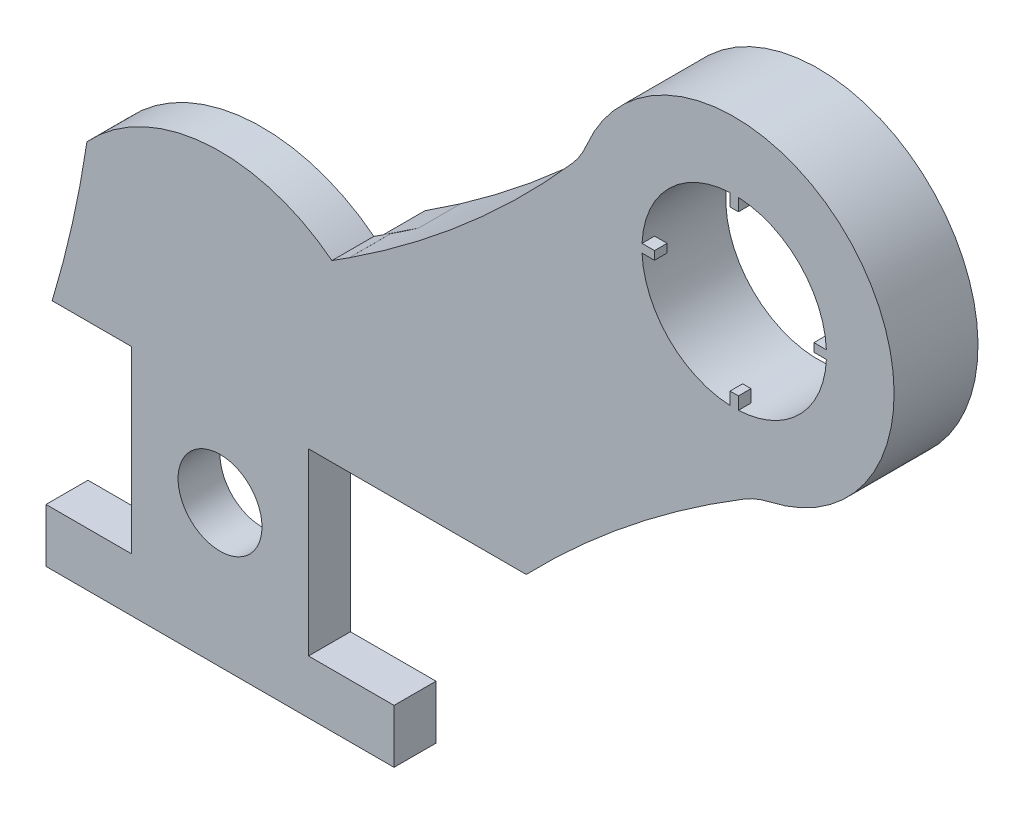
from build123d import *

# Parameters (mm, degrees)
BODY_DEPTH            = 10
SKETCH2_R             = 5
ATTACHMENT_HOLE_DEPTH = 115.950033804
CUT_EXTRUDE28_DEPTH   = 115.950033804
CUT_EXTRUDE30_DEPTH   = 5
FILLET1_R             = 10
FILLET2_R             = 10
SKETCH36_R            = 11
CUT_EXTRUDE31_DEPTH   = 10
CIRPATTERN2_COUNT     = 2
CIRPATTERN2_ANGLE     = 50
CUT_EXTRUDE32_DEPTH   = 10
CUT_EXTRUDE33_DEPTH   = 10
CUT_EXTRUDE35_DEPTH   = 10
CUT_EXTRUDE39_DEPTH   = 5
BOSS_EXTRUDE1_DEPTH   = 5
SKETCH43_W            = 1
SKETCH43_H            = 3
SKETCH43_W_2          = 3
SKETCH43_H_2          = 1
BOSS_EXTRUDE2_DEPTH   = 1.5


with BuildPart() as part:
    # Sketch1 → Body (new body)
    with BuildSketch(Plane.XY):
        with BuildLine():
            ThreePointArc((-57.453333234, -48.209070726), (-21.71033315, 5.618934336), (-16.22448152, 70))
            ThreePointArc((-16.22448152, 70), (0, 99.05869357), (16.22448152, 70))
            ThreePointArc((16.22448152, 70), (21.71033315, 5.618934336), (57.453333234, -48.209070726))
            ThreePointArc((57.453333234, -48.209070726), (0, -75), (-57.453333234, -48.209070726))
        make_face()
    extrude(amount=BODY_DEPTH)

    # Sketch2 → Attachment Hole (cut, through all)
    with BuildSketch(Plane.XY.offset(10)):
        Circle(SKETCH2_R)
    extrude(amount=-ATTACHMENT_HOLE_DEPTH, mode=Mode.SUBTRACT)

    # Sketch34 → Cut-Extrude28 (cut, through all)
    with BuildSketch(Plane.XY.offset(10)):
        with BuildLine():
            Line((-20.993197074, 10.845815), (-10.542895, 10.845815))
            Line((-10.542895, 10.845815), (-10.542895, -10.542895))
            Line((-10.542895, -10.542895), (-20.741205, -10.542895))
            Line((-20.741205, -10.542895), (-20.741205, -16.942445))
            Line((-20.741205, -16.942445), (20.741205, -16.942445))
            Line((20.741205, -16.942445), (20.741205, -10.542895))
            Line((20.741205, -10.542895), (10.542895, -10.542895))
            Line((10.542895, -10.542895), (10.542895, 10.845815))
            Line((10.542895, 10.845815), (20.993197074, 10.845815))
            ThreePointArc((20.993197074, 10.845815), (36.689111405, -20.246199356), (57.453333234, -48.209070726))
            ThreePointArc((57.453333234, -48.209070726), (0, -75), (-57.453333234, -48.209070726))
            ThreePointArc((-57.453333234, -48.209070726), (-35.302517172, -21.102274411), (-20.993197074, 10.845815))
        make_face()
    extrude(amount=-CUT_EXTRUDE28_DEPTH, mode=Mode.SUBTRACT)

    # Sketch35 → Cut-Extrude30 (cut)
    with BuildSketch(Plane(origin=(0, 0, 0), x_dir=(-1, 0, 0), z_dir=(0, 0, -1))):
        with BuildLine():
            Line((20.993197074, 10.845815), (10.542895, 10.845815))
            Line((10.542895, 10.845815), (10.542895, -10.542895))
            Line((10.542895, -10.542895), (20.741205, -10.542895))
            Line((20.741205, -10.542895), (20.741205, -16.942445))
            Line((20.741205, -16.942445), (-20.741205, -16.942445))
            Line((-20.741205, -16.942445), (-20.741205, -10.542895))
            Line((-20.741205, -10.542895), (-10.542895, -10.542895))
            Line((-10.542895, -10.542895), (-10.542895, 10.845815))
            Line((-10.542895, 10.845815), (-20.993197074, 10.845815))
            ThreePointArc((-20.993197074, 10.845815), (-18.675130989, 19.753520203), (-16.85963199, 28.777078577))
            ThreePointArc((-16.85963199, 28.777078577), (0, 36.631345), (16.85963199, 28.777078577))
            ThreePointArc((16.85963199, 28.777078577), (18.631142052, 19.74337975), (20.993197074, 10.845815))
        make_face()
    extrude(amount=-CUT_EXTRUDE30_DEPTH, mode=Mode.SUBTRACT)

    # Fillet1
    fillet1_edges = [part.edges().sort_by_distance(p)[0] for p in [
        (16.22448152, 70, 5),
    ]]
    fillet(fillet1_edges, radius=FILLET1_R)

    # Fillet2
    fillet2_edges = [part.edges().sort_by_distance(p)[0] for p in [
        (-16.22448152, 70, 5),
    ]]
    fillet(fillet2_edges, radius=FILLET2_R)

    # Sketch36 → Cut-Extrude31 (cut)
    with BuildSketch(Plane.XY.offset(10)):
        with Locations((0, 80)):
            Circle(SKETCH36_R)
    extrude(amount=-CUT_EXTRUDE31_DEPTH, mode=Mode.SUBTRACT)


with BuildPart() as cirpattern2_1:
    # CirPattern2: pattern copy
    add(part.part.rotate(Axis((0, 0, 0), (0, 0, -1)), 1 * CIRPATTERN2_ANGLE / (CIRPATTERN2_COUNT - 1)))


with BuildPart() as cut_extrude32_tool:
    # Sketch37 → Cut-Extrude32 (new body)
    with BuildSketch(Plane(origin=(0, 0, 0), x_dir=(-1, 0, 0), z_dir=(0, 0, -1))):
        Polygon((10.542895, 10.845815), (34.076027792, 10.845815), (33.80424088, -11.158579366), (20.741205, -10.542895), (10.542895, -10.542895), align=None)
        Polygon((-8.248307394, -16.942445), (10.542895, -16.942445), (10.542895, -32.17907609), (-8.248307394, -31.293412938), align=None)
        Polygon((-20.741205, -10.542895), (-10.542895, -10.542895), (-10.542895, 10.845815), (-26.542503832, 10.845815), (-26.542503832, -10.542895), align=None)
        Polygon((-23.641854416, 102.332870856), (-23.641854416, 42.267932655), (50.932087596, 42.267932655), (49.628646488, 108.669066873), align=None)
    extrude(amount=-CUT_EXTRUDE32_DEPTH)


with BuildPart() as part_1:
    add(part.part)

    # Cut-Extrude32: cut by cut_extrude32_tool
    add(cut_extrude32_tool.part, mode=Mode.SUBTRACT)

    # Sketch40 → Cut-Extrude35 (cut)
    with BuildSketch(Plane(origin=(0, 0, 0), x_dir=(-1, 0, 0), z_dir=(0, 0, -1))):
        with BuildLine():
            Line((31.566739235, 45.457488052), (-15.722771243, 46.486698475))
            Line((-15.722771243, 46.486698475), (-15.722771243, 33.198829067))
            Line((-15.722771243, 33.198829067), (-15.373922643, 32.974848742))
            ThreePointArc((-15.373922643, 32.974848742), (-14.900241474, 37.614400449), (-14.592911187, 42.267932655))
            Line((-14.592911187, 42.267932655), (14.592911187, 42.267932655))
            ThreePointArc((14.592911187, 42.267932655), (15.035374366, 36.110906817), (15.768973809, 29.981749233))
            ThreePointArc((15.768973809, 29.981749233), (1.415931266, 36.585778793), (-13.665905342, 31.87820604))
            Line((-13.665905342, 31.878206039), (-13.33663844, 31.66679826))
            ThreePointArc((-13.33663844, 31.66679826), (7.807845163, 34.817396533), (21.296566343, 18.23216644))
            Line((21.296566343, 18.23216644), (31.566739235, 45.457488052))
        make_face()
        with BuildLine():
            ThreePointArc((-14.592911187, 42.267932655), (-14.900241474, 37.614400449), (-15.373922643, 32.974848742))
            Line((-15.373922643, 32.974848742), (-13.665905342, 31.878206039))
            ThreePointArc((-13.665905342, 31.87820604), (1.415931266, 36.585778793), (15.768973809, 29.981749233))
            ThreePointArc((15.768973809, 29.981749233), (15.035374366, 36.110906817), (14.592911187, 42.267932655))
            Line((14.592911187, 42.267932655), (-14.592911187, 42.267932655))
        make_face()
    extrude(amount=-CUT_EXTRUDE35_DEPTH, mode=Mode.SUBTRACT)


with BuildPart() as cirpattern2_1_1:
    add(cirpattern2_1.part)

    # Cut-Extrude32: cut by cut_extrude32_tool
    add(cut_extrude32_tool.part, mode=Mode.SUBTRACT)

    # Sketch39 → Cut-Extrude33 (cut)
    with BuildSketch(Plane(origin=(0, 0, 0), x_dir=(-1, 0, 0), z_dir=(0, 0, -1))):
        Polygon((-10.542895, 10.845815), (-54.293106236, 10.845815), (-54.293106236, -6.503585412), (-10.542895, -4.673192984), align=None)
    extrude(amount=-CUT_EXTRUDE33_DEPTH, mode=Mode.SUBTRACT)


with BuildPart() as cut_extrude39_tool:
    # Sketch41 → Cut-Extrude39 (new body)
    with BuildSketch(Plane(origin=(0, 0, 0), x_dir=(-1, 0, 0), z_dir=(0, 0, -1))):
        Polygon((-18.671907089, 35.196255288), (-37.490611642, 11.85977344), (-39.319091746, 4.517472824), (-24.223434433, -3.118152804), (-5.05066714, 30.650341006), align=None)
    extrude(amount=-CUT_EXTRUDE39_DEPTH)


with BuildPart() as part_2:
    add(part_1.part)

    # Cut-Extrude39: cut by cut_extrude39_tool
    add(cut_extrude39_tool.part, mode=Mode.SUBTRACT)



with BuildPart() as cirpattern2_1_2:
    add(cirpattern2_1_1.part)

    # Cut-Extrude39: cut by cut_extrude39_tool
    add(cut_extrude39_tool.part, mode=Mode.SUBTRACT)


with BuildPart() as part_3:
    add(part_2.part)

    add(cirpattern2_1_2.part)  # Boss-Extrude1 merges CirPattern2_1
    # Sketch42 → Boss-Extrude1 (add)
    with BuildSketch(Plane(origin=(0, 0, 5), x_dir=(-1, 0, 0), z_dir=(0, 0, -1))):
        with BuildLine():
            Line((-37.490611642, 11.85977344), (-36.500337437, 10.845815))
            Line((-36.500337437, 10.845815), (-22.705702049, 10.845815))
            Line((-22.705702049, 10.845815), (-19.861751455, 22.208176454))
            ThreePointArc((-19.861751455, 22.208176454), (-17.769898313, 27.618233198), (-14.416930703, 32.351326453))
            Line((-14.416930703, 32.351326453), (-18.671907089, 35.196255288))
            Line((-18.671907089, 35.196255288), (-37.490611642, 11.85977344))
        make_face()
    extrude(amount=BOSS_EXTRUDE1_DEPTH)

    # Sketch43 → Boss-Extrude2 (add)
    with BuildSketch(Plane(origin=(0, 0, 10), x_dir=(-1, 0, 0), z_dir=(0, 0, -1))):
        with Locations((-61.28355545, 40.423008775)):
            Rectangle(SKETCH43_W, SKETCH43_H)
        with Locations((-50.28355545, 51.423008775)):
            Rectangle(SKETCH43_W_2, SKETCH43_H_2)
        with Locations((-61.28355545, 62.423008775)):
            Rectangle(SKETCH43_W, SKETCH43_H)
        with Locations((-72.28355545, 51.423008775)):
            Rectangle(SKETCH43_W_2, SKETCH43_H_2)
    extrude(amount=BOSS_EXTRUDE2_DEPTH)


solid = part_3.part
